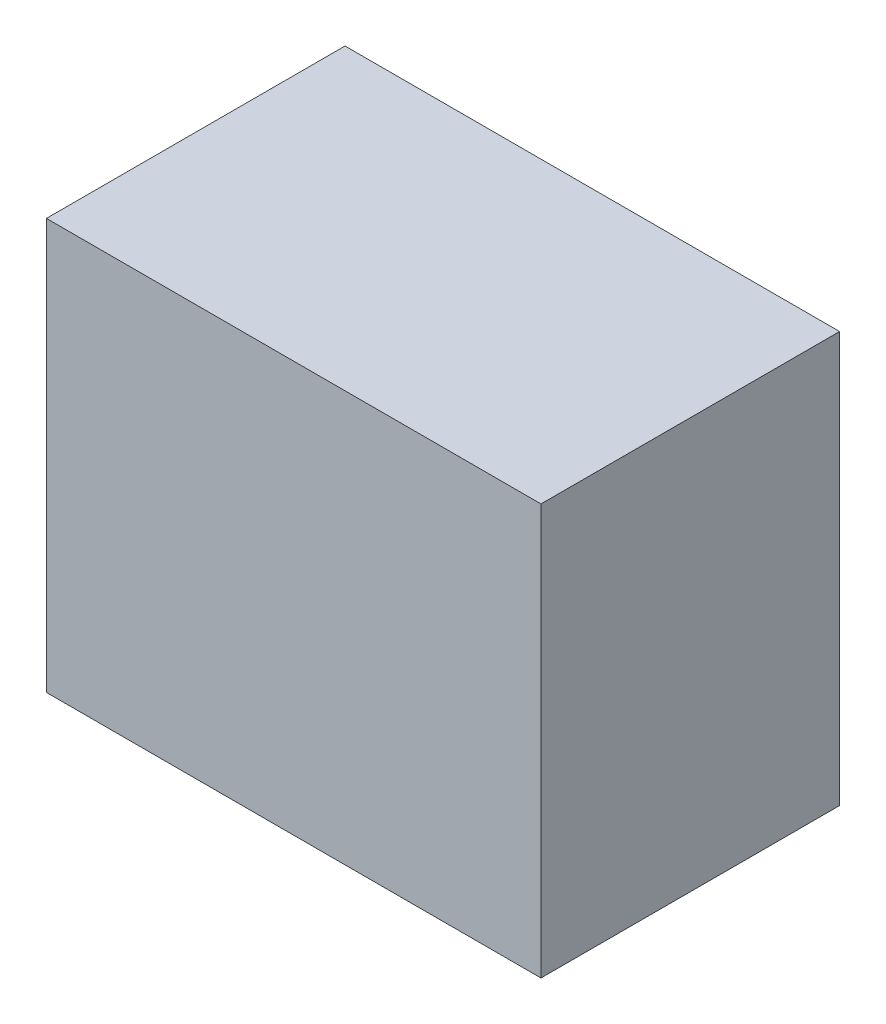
ISO-10303-21;
HEADER;
FILE_DESCRIPTION(('STEP AP214'),'2;1');
FILE_NAME('part.step','',(''),(''),'','','');
FILE_SCHEMA(('AUTOMOTIVE_DESIGN { 1 0 10303 214 1 1 1 1 }'));
ENDSEC;
DATA;
#1=APPLICATION_CONTEXT('core data for automotive mechanical design processes');
#2=APPLICATION_PROTOCOL_DEFINITION('international standard','automotive_design',2000,#1);
#3=PRODUCT_CONTEXT('',#1,'mechanical');
#4=PRODUCT('Part','Part','',(#3));
#5=PRODUCT_RELATED_PRODUCT_CATEGORY('part','',(#4));
#6=PRODUCT_DEFINITION_FORMATION('','',#4);
#7=PRODUCT_DEFINITION_CONTEXT('part definition',#1,'design');
#8=PRODUCT_DEFINITION('design','',#6,#7);
#9=PRODUCT_DEFINITION_SHAPE('','',#8);
#10=(LENGTH_UNIT() NAMED_UNIT(*) SI_UNIT(.MILLI.,.METRE.));
#11=(NAMED_UNIT(*) PLANE_ANGLE_UNIT() SI_UNIT($,.RADIAN.));
#12=(NAMED_UNIT(*) SI_UNIT($,.STERADIAN.) SOLID_ANGLE_UNIT());
#13=UNCERTAINTY_MEASURE_WITH_UNIT(LENGTH_MEASURE(1.E-05),#10,'distance_accuracy_value','');
#14=(GEOMETRIC_REPRESENTATION_CONTEXT(3) GLOBAL_UNCERTAINTY_ASSIGNED_CONTEXT((#13)) GLOBAL_UNIT_ASSIGNED_CONTEXT((#10,
#11,#12)) REPRESENTATION_CONTEXT('',''));
#15=CARTESIAN_POINT('',(0.,0.,0.));
#16=DIRECTION('',(0.,0.,1.));
#17=DIRECTION('',(1.,0.,0.));
#18=AXIS2_PLACEMENT_3D('',#15,#16,#17);
#19=CARTESIAN_POINT('',(0.,0.,0.));
#20=DIRECTION('',(0.,-1.,0.));
#21=DIRECTION('',(0.,0.,-1.));
#22=AXIS2_PLACEMENT_3D('',#19,#20,#21);
#23=PLANE('',#22);
#24=DIRECTION('',(0.,0.,-1.));
#25=VECTOR('',#24,1.);
#26=CARTESIAN_POINT('',(2.65,0.,1.6));
#27=LINE('',#26,#25);
#28=CARTESIAN_POINT('',(2.65,0.,1.6));
#29=VERTEX_POINT('',#28);
#30=CARTESIAN_POINT('',(2.65,0.,-1.6));
#31=VERTEX_POINT('',#30);
#32=EDGE_CURVE('E101',#29,#31,#27,.T.);
#33=ORIENTED_EDGE('',*,*,#32,.F.);
#34=DIRECTION('',(1.,0.,0.));
#35=VECTOR('',#34,1.);
#36=CARTESIAN_POINT('',(-2.65,0.,1.6));
#37=LINE('',#36,#35);
#38=CARTESIAN_POINT('',(-2.65,0.,1.6));
#39=VERTEX_POINT('',#38);
#40=EDGE_CURVE('E27',#39,#29,#37,.T.);
#41=ORIENTED_EDGE('',*,*,#40,.F.);
#42=DIRECTION('',(0.,0.,1.));
#43=VECTOR('',#42,1.);
#44=CARTESIAN_POINT('',(-2.65,0.,1.6));
#45=LINE('',#44,#43);
#46=CARTESIAN_POINT('',(-2.65,0.,-1.6));
#47=VERTEX_POINT('',#46);
#48=EDGE_CURVE('E20',#47,#39,#45,.T.);
#49=ORIENTED_EDGE('',*,*,#48,.F.);
#50=DIRECTION('',(-1.,0.,0.));
#51=VECTOR('',#50,1.);
#52=CARTESIAN_POINT('',(-2.65,0.,-1.6));
#53=LINE('',#52,#51);
#54=EDGE_CURVE('E81',#31,#47,#53,.T.);
#55=ORIENTED_EDGE('',*,*,#54,.F.);
#56=EDGE_LOOP('',(#33,#41,#49,#55));
#57=FACE_BOUND('',#56,.T.);
#58=ADVANCED_FACE('F17',(#57),#23,.T.);
#59=CARTESIAN_POINT('',(0.,4.4,0.));
#60=DIRECTION('',(0.,-1.,0.));
#61=DIRECTION('',(0.,0.,-1.));
#62=AXIS2_PLACEMENT_3D('',#59,#60,#61);
#63=PLANE('',#62);
#64=DIRECTION('',(0.,0.,-1.));
#65=VECTOR('',#64,1.);
#66=CARTESIAN_POINT('',(2.65,4.4,1.6));
#67=LINE('',#66,#65);
#68=CARTESIAN_POINT('',(2.65,4.4,1.6));
#69=VERTEX_POINT('',#68);
#70=CARTESIAN_POINT('',(2.65,4.4,-1.6));
#71=VERTEX_POINT('',#70);
#72=EDGE_CURVE('E73',#69,#71,#67,.T.);
#73=ORIENTED_EDGE('',*,*,#72,.T.);
#74=DIRECTION('',(-1.,0.,0.));
#75=VECTOR('',#74,1.);
#76=CARTESIAN_POINT('',(-2.65,4.4,-1.6));
#77=LINE('',#76,#75);
#78=CARTESIAN_POINT('',(-2.65,4.4,-1.6));
#79=VERTEX_POINT('',#78);
#80=EDGE_CURVE('E69',#71,#79,#77,.T.);
#81=ORIENTED_EDGE('',*,*,#80,.T.);
#82=DIRECTION('',(0.,0.,1.));
#83=VECTOR('',#82,1.);
#84=CARTESIAN_POINT('',(-2.65,4.4,1.6));
#85=LINE('',#84,#83);
#86=CARTESIAN_POINT('',(-2.65,4.4,1.6));
#87=VERTEX_POINT('',#86);
#88=EDGE_CURVE('E56',#79,#87,#85,.T.);
#89=ORIENTED_EDGE('',*,*,#88,.T.);
#90=DIRECTION('',(1.,0.,0.));
#91=VECTOR('',#90,1.);
#92=CARTESIAN_POINT('',(-2.65,4.4,1.6));
#93=LINE('',#92,#91);
#94=EDGE_CURVE('E11',#87,#69,#93,.T.);
#95=ORIENTED_EDGE('',*,*,#94,.T.);
#96=EDGE_LOOP('',(#73,#81,#89,#95));
#97=FACE_BOUND('',#96,.T.);
#98=ADVANCED_FACE('F70',(#97),#63,.F.);
#99=CARTESIAN_POINT('',(-2.65,4.4,1.6));
#100=DIRECTION('',(0.,0.,-1.));
#101=DIRECTION('',(0.,-1.,0.));
#102=AXIS2_PLACEMENT_3D('',#99,#100,#101);
#103=PLANE('',#102);
#104=ORIENTED_EDGE('',*,*,#40,.T.);
#105=DIRECTION('',(0.,-1.,0.));
#106=VECTOR('',#105,1.);
#107=CARTESIAN_POINT('',(2.65,4.4,1.6));
#108=LINE('',#107,#106);
#109=EDGE_CURVE('E88',#69,#29,#108,.T.);
#110=ORIENTED_EDGE('',*,*,#109,.F.);
#111=ORIENTED_EDGE('',*,*,#94,.F.);
#112=DIRECTION('',(0.,-1.,0.));
#113=VECTOR('',#112,1.);
#114=CARTESIAN_POINT('',(-2.65,4.4,1.6));
#115=LINE('',#114,#113);
#116=EDGE_CURVE('E63',#87,#39,#115,.T.);
#117=ORIENTED_EDGE('',*,*,#116,.T.);
#118=EDGE_LOOP('',(#104,#110,#111,#117));
#119=FACE_BOUND('',#118,.T.);
#120=ADVANCED_FACE('F126',(#119),#103,.F.);
#121=CARTESIAN_POINT('',(-2.65,4.4,1.6));
#122=DIRECTION('',(1.,0.,0.));
#123=DIRECTION('',(0.,1.,0.));
#124=AXIS2_PLACEMENT_3D('',#121,#122,#123);
#125=PLANE('',#124);
#126=ORIENTED_EDGE('',*,*,#48,.T.);
#127=ORIENTED_EDGE('',*,*,#116,.F.);
#128=ORIENTED_EDGE('',*,*,#88,.F.);
#129=DIRECTION('',(0.,-1.,0.));
#130=VECTOR('',#129,1.);
#131=CARTESIAN_POINT('',(-2.65,4.4,-1.6));
#132=LINE('',#131,#130);
#133=EDGE_CURVE('E61',#79,#47,#132,.T.);
#134=ORIENTED_EDGE('',*,*,#133,.T.);
#135=EDGE_LOOP('',(#126,#127,#128,#134));
#136=FACE_BOUND('',#135,.T.);
#137=ADVANCED_FACE('F59',(#136),#125,.F.);
#138=CARTESIAN_POINT('',(-2.65,4.4,-1.6));
#139=DIRECTION('',(0.,0.,1.));
#140=DIRECTION('',(1.,0.,0.));
#141=AXIS2_PLACEMENT_3D('',#138,#139,#140);
#142=PLANE('',#141);
#143=ORIENTED_EDGE('',*,*,#54,.T.);
#144=ORIENTED_EDGE('',*,*,#133,.F.);
#145=ORIENTED_EDGE('',*,*,#80,.F.);
#146=DIRECTION('',(0.,-1.,0.));
#147=VECTOR('',#146,1.);
#148=CARTESIAN_POINT('',(2.65,4.4,-1.6));
#149=LINE('',#148,#147);
#150=EDGE_CURVE('E100',#71,#31,#149,.T.);
#151=ORIENTED_EDGE('',*,*,#150,.T.);
#152=EDGE_LOOP('',(#143,#144,#145,#151));
#153=FACE_BOUND('',#152,.T.);
#154=ADVANCED_FACE('F79',(#153),#142,.F.);
#155=CARTESIAN_POINT('',(2.65,4.4,1.6));
#156=DIRECTION('',(-1.,0.,0.));
#157=DIRECTION('',(0.,0.,1.));
#158=AXIS2_PLACEMENT_3D('',#155,#156,#157);
#159=PLANE('',#158);
#160=ORIENTED_EDGE('',*,*,#32,.T.);
#161=ORIENTED_EDGE('',*,*,#150,.F.);
#162=ORIENTED_EDGE('',*,*,#72,.F.);
#163=ORIENTED_EDGE('',*,*,#109,.T.);
#164=EDGE_LOOP('',(#160,#161,#162,#163));
#165=FACE_BOUND('',#164,.T.);
#166=ADVANCED_FACE('F114',(#165),#159,.F.);
#167=CLOSED_SHELL('',(#58,#98,#120,#137,#154,#166));
#168=MANIFOLD_SOLID_BREP('B1',#167);
#169=ADVANCED_BREP_SHAPE_REPRESENTATION('',(#18,#168),#14);
#170=SHAPE_DEFINITION_REPRESENTATION(#9,#169);
ENDSEC;
END-ISO-10303-21;
